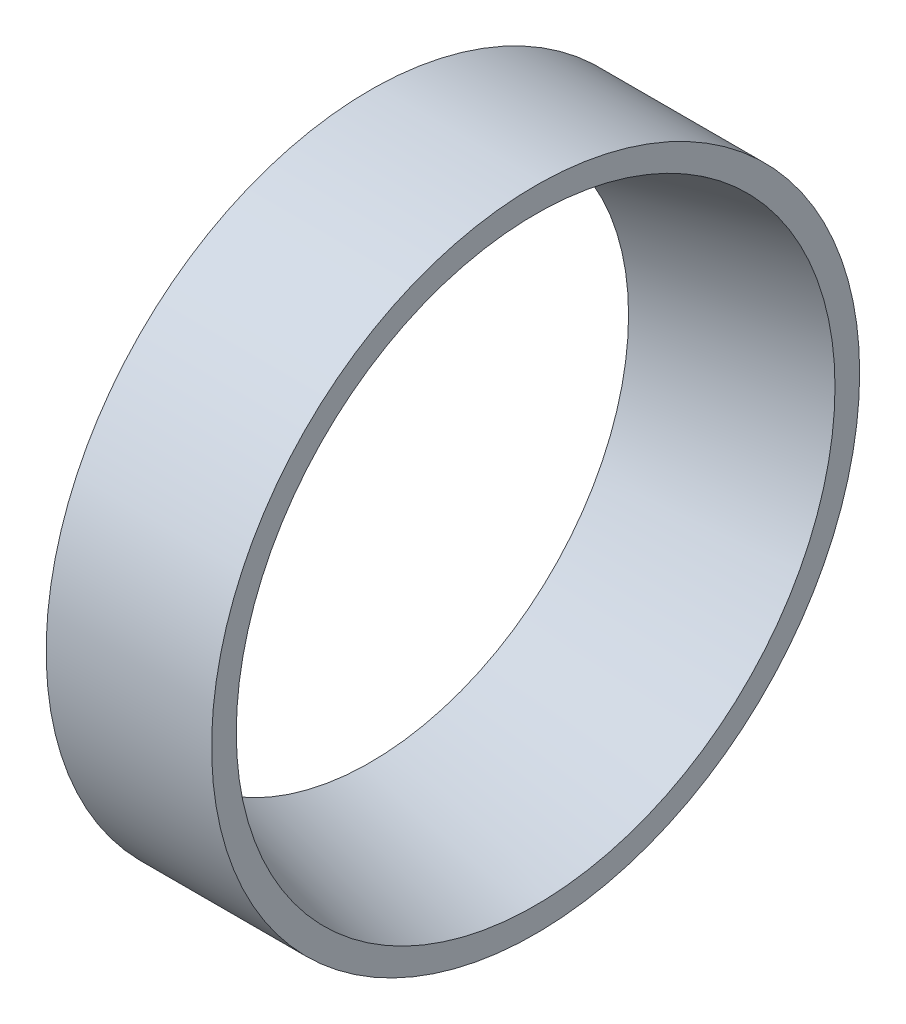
ISO-10303-21;
HEADER;
FILE_DESCRIPTION(('STEP AP214'),'2;1');
FILE_NAME('part.step','',(''),(''),'','','');
FILE_SCHEMA(('AUTOMOTIVE_DESIGN { 1 0 10303 214 1 1 1 1 }'));
ENDSEC;
DATA;
#1=APPLICATION_CONTEXT('core data for automotive mechanical design processes');
#2=APPLICATION_PROTOCOL_DEFINITION('international standard','automotive_design',2000,#1);
#3=PRODUCT_CONTEXT('',#1,'mechanical');
#4=PRODUCT('Part','Part','',(#3));
#5=PRODUCT_RELATED_PRODUCT_CATEGORY('part','',(#4));
#6=PRODUCT_DEFINITION_FORMATION('','',#4);
#7=PRODUCT_DEFINITION_CONTEXT('part definition',#1,'design');
#8=PRODUCT_DEFINITION('design','',#6,#7);
#9=PRODUCT_DEFINITION_SHAPE('','',#8);
#10=(LENGTH_UNIT() NAMED_UNIT(*) SI_UNIT(.MILLI.,.METRE.));
#11=(NAMED_UNIT(*) PLANE_ANGLE_UNIT() SI_UNIT($,.RADIAN.));
#12=(NAMED_UNIT(*) SI_UNIT($,.STERADIAN.) SOLID_ANGLE_UNIT());
#13=UNCERTAINTY_MEASURE_WITH_UNIT(LENGTH_MEASURE(1.E-05),#10,'distance_accuracy_value','');
#14=(GEOMETRIC_REPRESENTATION_CONTEXT(3) GLOBAL_UNCERTAINTY_ASSIGNED_CONTEXT((#13)) GLOBAL_UNIT_ASSIGNED_CONTEXT((#10,
#11,#12)) REPRESENTATION_CONTEXT('',''));
#15=CARTESIAN_POINT('',(0.,0.,0.));
#16=DIRECTION('',(0.,0.,1.));
#17=DIRECTION('',(1.,0.,0.));
#18=AXIS2_PLACEMENT_3D('',#15,#16,#17);
#19=CARTESIAN_POINT('',(-12.,0.,0.));
#20=DIRECTION('',(1.,0.,0.));
#21=DIRECTION('',(0.,0.,-1.));
#22=AXIS2_PLACEMENT_3D('',#19,#20,#21);
#23=CONICAL_SURFACE('',#22,18.74,0.242781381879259);
#24=CARTESIAN_POINT('',(0.,0.,0.));
#25=DIRECTION('',(1.,0.,0.));
#26=DIRECTION('',(0.,0.,-1.));
#27=AXIS2_PLACEMENT_3D('',#24,#25,#26);
#28=CIRCLE('',#27,21.712);
#29=CARTESIAN_POINT('',(0.,0.,-21.712));
#30=VERTEX_POINT('',#29);
#31=EDGE_CURVE('E10',#30,#30,#28,.T.);
#32=ORIENTED_EDGE('',*,*,#31,.T.);
#33=EDGE_LOOP('',(#32));
#34=FACE_BOUND('',#33,.T.);
#35=CARTESIAN_POINT('',(-12.,0.,0.));
#36=DIRECTION('',(1.,0.,0.));
#37=DIRECTION('',(0.,0.,-1.));
#38=AXIS2_PLACEMENT_3D('',#35,#36,#37);
#39=CIRCLE('',#38,18.74);
#40=CARTESIAN_POINT('',(-12.,0.,-18.74));
#41=VERTEX_POINT('',#40);
#42=EDGE_CURVE('E36',#41,#41,#39,.T.);
#43=ORIENTED_EDGE('',*,*,#42,.F.);
#44=EDGE_LOOP('',(#43));
#45=FACE_BOUND('',#44,.T.);
#46=ADVANCED_FACE('F22',(#34,#45),#23,.F.);
#47=CARTESIAN_POINT('',(0.,21.712,0.));
#48=DIRECTION('',(1.,0.,0.));
#49=DIRECTION('',(0.,0.,-1.));
#50=AXIS2_PLACEMENT_3D('',#47,#48,#49);
#51=PLANE('',#50);
#52=CARTESIAN_POINT('',(0.,0.,0.));
#53=DIRECTION('',(1.,0.,0.));
#54=DIRECTION('',(0.,0.,-1.));
#55=AXIS2_PLACEMENT_3D('',#52,#53,#54);
#56=CIRCLE('',#55,23.5);
#57=CARTESIAN_POINT('',(0.,0.,-23.5));
#58=VERTEX_POINT('',#57);
#59=EDGE_CURVE('E28',#58,#58,#56,.T.);
#60=ORIENTED_EDGE('',*,*,#59,.T.);
#61=EDGE_LOOP('',(#60));
#62=FACE_BOUND('',#61,.T.);
#63=ORIENTED_EDGE('',*,*,#31,.F.);
#64=EDGE_LOOP('',(#63));
#65=FACE_BOUND('',#64,.T.);
#66=ADVANCED_FACE('F46',(#62,#65),#51,.T.);
#67=CARTESIAN_POINT('',(40.,0.,0.));
#68=DIRECTION('',(1.,0.,0.));
#69=DIRECTION('',(0.,0.,-1.));
#70=AXIS2_PLACEMENT_3D('',#67,#68,#69);
#71=CYLINDRICAL_SURFACE('',#70,23.5);
#72=CARTESIAN_POINT('',(-12.,0.,0.));
#73=DIRECTION('',(1.,0.,0.));
#74=DIRECTION('',(0.,0.,-1.));
#75=AXIS2_PLACEMENT_3D('',#72,#73,#74);
#76=CIRCLE('',#75,23.5);
#77=CARTESIAN_POINT('',(-12.,0.,-23.5));
#78=VERTEX_POINT('',#77);
#79=EDGE_CURVE('E32',#78,#78,#76,.T.);
#80=ORIENTED_EDGE('',*,*,#79,.T.);
#81=EDGE_LOOP('',(#80));
#82=FACE_BOUND('',#81,.T.);
#83=ORIENTED_EDGE('',*,*,#59,.F.);
#84=EDGE_LOOP('',(#83));
#85=FACE_BOUND('',#84,.T.);
#86=ADVANCED_FACE('F50',(#82,#85),#71,.T.);
#87=CARTESIAN_POINT('',(-12.,23.5,0.));
#88=DIRECTION('',(-1.,0.,0.));
#89=DIRECTION('',(0.,0.,1.));
#90=AXIS2_PLACEMENT_3D('',#87,#88,#89);
#91=PLANE('',#90);
#92=ORIENTED_EDGE('',*,*,#42,.T.);
#93=EDGE_LOOP('',(#92));
#94=FACE_BOUND('',#93,.T.);
#95=ORIENTED_EDGE('',*,*,#79,.F.);
#96=EDGE_LOOP('',(#95));
#97=FACE_BOUND('',#96,.T.);
#98=ADVANCED_FACE('F42',(#94,#97),#91,.T.);
#99=CLOSED_SHELL('',(#46,#66,#86,#98));
#100=MANIFOLD_SOLID_BREP('B2',#99);
#101=ADVANCED_BREP_SHAPE_REPRESENTATION('',(#18,#100),#14);
#102=SHAPE_DEFINITION_REPRESENTATION(#9,#101);
ENDSEC;
END-ISO-10303-21;
